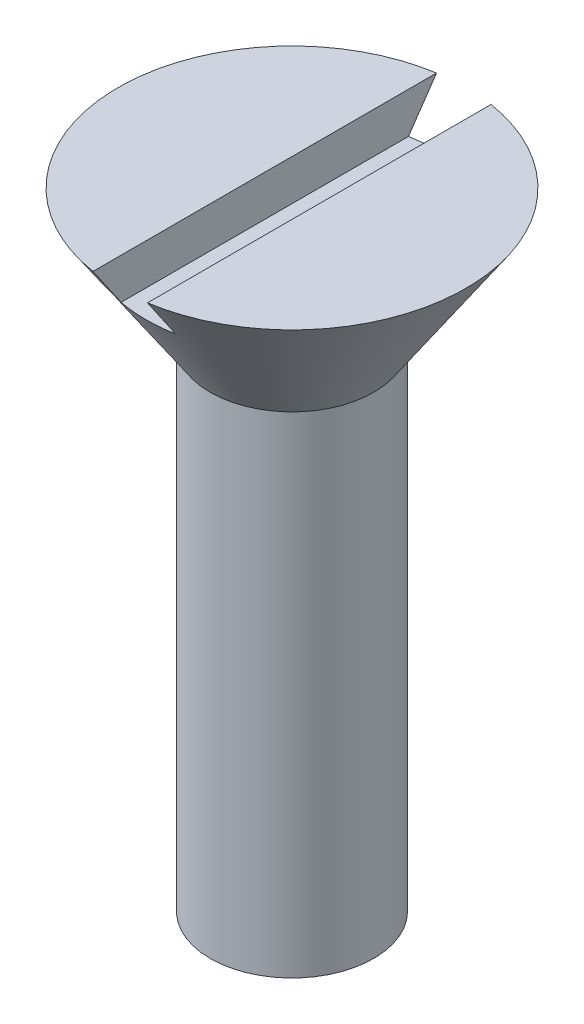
ISO-10303-21;
HEADER;
FILE_DESCRIPTION(('STEP AP214'),'2;1');
FILE_NAME('part.step','',(''),(''),'','','');
FILE_SCHEMA(('AUTOMOTIVE_DESIGN { 1 0 10303 214 1 1 1 1 }'));
ENDSEC;
DATA;
#1=APPLICATION_CONTEXT('core data for automotive mechanical design processes');
#2=APPLICATION_PROTOCOL_DEFINITION('international standard','automotive_design',2000,#1);
#3=PRODUCT_CONTEXT('',#1,'mechanical');
#4=PRODUCT('Part','Part','',(#3));
#5=PRODUCT_RELATED_PRODUCT_CATEGORY('part','',(#4));
#6=PRODUCT_DEFINITION_FORMATION('','',#4);
#7=PRODUCT_DEFINITION_CONTEXT('part definition',#1,'design');
#8=PRODUCT_DEFINITION('design','',#6,#7);
#9=PRODUCT_DEFINITION_SHAPE('','',#8);
#10=(LENGTH_UNIT() NAMED_UNIT(*) SI_UNIT(.MILLI.,.METRE.));
#11=(NAMED_UNIT(*) PLANE_ANGLE_UNIT() SI_UNIT($,.RADIAN.));
#12=(NAMED_UNIT(*) SI_UNIT($,.STERADIAN.) SOLID_ANGLE_UNIT());
#13=UNCERTAINTY_MEASURE_WITH_UNIT(LENGTH_MEASURE(1.E-05),#10,'distance_accuracy_value','');
#14=(GEOMETRIC_REPRESENTATION_CONTEXT(3) GLOBAL_UNCERTAINTY_ASSIGNED_CONTEXT((#13)) GLOBAL_UNIT_ASSIGNED_CONTEXT((#10,
#11,#12)) REPRESENTATION_CONTEXT('',''));
#15=CARTESIAN_POINT('',(0.,0.,0.));
#16=DIRECTION('',(0.,0.,1.));
#17=DIRECTION('',(1.,0.,0.));
#18=AXIS2_PLACEMENT_3D('',#15,#16,#17);
#19=CARTESIAN_POINT('',(0.,0.,0.));
#20=DIRECTION('',(0.,-1.,0.));
#21=DIRECTION('',(0.,0.,-1.));
#22=AXIS2_PLACEMENT_3D('',#19,#20,#21);
#23=PLANE('',#22);
#24=CARTESIAN_POINT('',(0.,0.,0.));
#25=DIRECTION('',(0.,1.,0.));
#26=DIRECTION('',(0.,0.,1.));
#27=AXIS2_PLACEMENT_3D('',#24,#25,#26);
#28=CIRCLE('',#27,6.385);
#29=CARTESIAN_POINT('',(-1.,0.,-6.30620527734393));
#30=VERTEX_POINT('',#29);
#31=CARTESIAN_POINT('',(-1.,0.,6.30620527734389));
#32=VERTEX_POINT('',#31);
#33=EDGE_CURVE('E120',#30,#32,#28,.T.);
#34=ORIENTED_EDGE('',*,*,#33,.T.);
#35=DIRECTION('',(0.,0.,1.));
#36=VECTOR('',#35,1.);
#37=CARTESIAN_POINT('',(-0.999999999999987,0.,-6.38500000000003));
#38=LINE('',#37,#36);
#39=EDGE_CURVE('E129',#30,#32,#38,.T.);
#40=ORIENTED_EDGE('',*,*,#39,.F.);
#41=EDGE_LOOP('',(#34,#40));
#42=FACE_BOUND('',#41,.T.);
#43=ADVANCED_FACE('F34',(#42),#23,.F.);
#44=CARTESIAN_POINT('',(0.999999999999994,0.,6.30620527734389));
#45=VERTEX_POINT('',#44);
#46=CARTESIAN_POINT('',(1.,0.,-6.30620527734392));
#47=VERTEX_POINT('',#46);
#48=EDGE_CURVE('E99',#45,#47,#28,.T.);
#49=ORIENTED_EDGE('',*,*,#48,.T.);
#50=DIRECTION('',(0.,0.,1.));
#51=VECTOR('',#50,1.);
#52=CARTESIAN_POINT('',(1.00000000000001,0.,-6.38500000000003));
#53=LINE('',#52,#51);
#54=EDGE_CURVE('E93',#47,#45,#53,.T.);
#55=ORIENTED_EDGE('',*,*,#54,.T.);
#56=EDGE_LOOP('',(#49,#55));
#57=FACE_BOUND('',#56,.T.);
#58=ADVANCED_FACE('F36',(#57),#23,.F.);
#59=CARTESIAN_POINT('',(0.,-5.,0.));
#60=DIRECTION('',(0.,1.,0.));
#61=DIRECTION('',(0.,0.,1.));
#62=AXIS2_PLACEMENT_3D('',#59,#60,#61);
#63=CONICAL_SURFACE('',#62,3.,0.595122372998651);
#64=CARTESIAN_POINT('',(0.,-1.5,0.));
#65=DIRECTION('',(0.,-1.,0.));
#66=DIRECTION('',(0.,0.,-1.));
#67=AXIS2_PLACEMENT_3D('',#64,#65,#66);
#68=CIRCLE('',#67,5.3695);
#69=CARTESIAN_POINT('',(1.00000000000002,-1.5,5.27555970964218));
#70=VERTEX_POINT('',#69);
#71=CARTESIAN_POINT('',(-0.999999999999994,-1.5,5.2755597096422));
#72=VERTEX_POINT('',#71);
#73=EDGE_CURVE('E78',#70,#72,#68,.T.);
#74=ORIENTED_EDGE('',*,*,#73,.T.);
#75=CARTESIAN_POINT('',(-1.,-6.90350895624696,1.38875171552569));
#76=CARTESIAN_POINT('',(-0.999999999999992,-6.8332015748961,1.44736594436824));
#77=CARTESIAN_POINT('',(-0.999999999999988,-6.76231638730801,1.5052762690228));
#78=CARTESIAN_POINT('',(-0.999999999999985,-6.61964733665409,1.61996716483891));
#79=CARTESIAN_POINT('',(-0.999999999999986,-6.54786355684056,1.67674783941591));
#80=CARTESIAN_POINT('',(-0.999999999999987,-6.40365845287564,1.78945470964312));
#81=CARTESIAN_POINT('',(-0.999999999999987,-6.33123728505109,1.84538110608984));
#82=CARTESIAN_POINT('',(-0.999999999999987,-6.18588439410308,1.95656982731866));
#83=CARTESIAN_POINT('',(-0.999999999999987,-6.11295265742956,2.01183213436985));
#84=CARTESIAN_POINT('',(-0.999999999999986,-5.89362110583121,2.17679172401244));
#85=CARTESIAN_POINT('',(-0.999999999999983,-5.74663095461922,2.28570350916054));
#86=CARTESIAN_POINT('',(-0.99999999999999,-5.45162144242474,2.50214259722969));
#87=CARTESIAN_POINT('',(-1.,-5.30360200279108,2.60966979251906));
#88=CARTESIAN_POINT('',(-1.,-4.9776447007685,2.84482016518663));
#89=CARTESIAN_POINT('',(-0.999999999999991,-4.79955427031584,2.97223167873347));
#90=CARTESIAN_POINT('',(-0.999999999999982,-4.44268749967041,3.22609061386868));
#91=CARTESIAN_POINT('',(-0.999999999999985,-4.26391115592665,3.35253803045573));
#92=CARTESIAN_POINT('',(-0.999999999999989,-3.72686966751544,3.73085317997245));
#93=CARTESIAN_POINT('',(-0.999999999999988,-3.36788501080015,3.98169886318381));
#94=CARTESIAN_POINT('',(-0.999999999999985,-2.64871797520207,4.4819664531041));
#95=CARTESIAN_POINT('',(-0.999999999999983,-2.28853518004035,4.73138775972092));
#96=CARTESIAN_POINT('',(-0.99999999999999,-1.56750489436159,5.22926709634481));
#97=CARTESIAN_POINT('',(-0.999999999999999,-1.20665740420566,5.47772512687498));
#98=CARTESIAN_POINT('',(-1.,-0.33382655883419,6.07757757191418));
#99=CARTESIAN_POINT('',(-0.999999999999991,0.178376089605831,6.42865269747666));
#100=CARTESIAN_POINT('',(-0.999999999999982,1.20330768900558,7.13003407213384));
#101=CARTESIAN_POINT('',(-0.999999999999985,1.7160366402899,7.4803403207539));
#102=CARTESIAN_POINT('',(-0.999999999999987,2.74148557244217,8.18020930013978));
#103=CARTESIAN_POINT('',(-0.999999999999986,3.25420531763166,8.5297723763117));
#104=CARTESIAN_POINT('',(-0.999999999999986,4.27988756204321,9.22854007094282));
#105=CARTESIAN_POINT('',(-0.999999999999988,4.7928500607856,9.57774469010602));
#106=CARTESIAN_POINT('',(-0.999999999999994,5.30588491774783,9.92684274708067));
#107=B_SPLINE_CURVE_WITH_KNOTS('',3,(#75,#76,#77,#78,#79,#80,#81,#82,#83,#84,#85,#86,#87,#88,
#89,#90,#91,#92,#93,#94,#95,#96,#97,#98,#99,#100,#101,#102,#103,#104,#105,#106),.UNSPECIFIED.,
.F.,.F.,(4,2,2,2,2,2,2,2,2,2,2,2,2,2,2,4),(0.,0.274592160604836,0.549159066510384,
0.823660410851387,1.09816906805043,1.64698149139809,2.19583632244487,2.85275512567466,
3.50967733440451,4.82349572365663,6.13783190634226,7.45216737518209,9.31507994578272,
11.1779936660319,13.0396279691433,14.9012586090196),.UNSPECIFIED.);
#108=EDGE_CURVE('E11',#72,#32,#107,.T.);
#109=ORIENTED_EDGE('',*,*,#108,.T.);
#110=ORIENTED_EDGE('',*,*,#33,.F.);
#111=CARTESIAN_POINT('',(-0.999999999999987,5.30588491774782,-9.9268427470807));
#112=CARTESIAN_POINT('',(-0.999999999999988,4.79263206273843,-9.5775961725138));
#113=CARTESIAN_POINT('',(-0.999999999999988,4.2794514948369,-9.22824311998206));
#114=CARTESIAN_POINT('',(-0.999999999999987,3.25335227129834,-8.52919107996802));
#115=CARTESIAN_POINT('',(-0.999999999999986,2.74043360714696,-8.17949210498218));
#116=CARTESIAN_POINT('',(-0.999999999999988,1.71500377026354,-7.47963461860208));
#117=CARTESIAN_POINT('',(-0.99999999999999,1.20249255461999,-7.12947617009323));
#118=CARTESIAN_POINT('',(-0.999999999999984,0.177977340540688,-6.42837990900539));
#119=CARTESIAN_POINT('',(-0.999999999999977,-0.334026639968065,-6.07744207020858));
#120=CARTESIAN_POINT('',(-0.999999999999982,-1.10143837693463,-5.55003583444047));
#121=CARTESIAN_POINT('',(-0.999999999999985,-1.35717461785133,-5.37404550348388));
#122=CARTESIAN_POINT('',(-0.999999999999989,-1.86834818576,-5.02163598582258));
#123=CARTESIAN_POINT('',(-0.999999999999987,-2.12378551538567,-4.84521680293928));
#124=CARTESIAN_POINT('',(-0.999999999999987,-2.63423012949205,-4.49180780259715));
#125=CARTESIAN_POINT('',(-0.999999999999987,-2.88923745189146,-4.3148180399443));
#126=CARTESIAN_POINT('',(-0.999999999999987,-3.39867790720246,-3.9599963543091));
#127=CARTESIAN_POINT('',(-0.999999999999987,-3.65311102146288,-3.78216440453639));
#128=CARTESIAN_POINT('',(-0.999999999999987,-4.16118973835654,-3.42520593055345));
#129=CARTESIAN_POINT('',(-0.999999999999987,-4.41483506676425,-3.2460790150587));
#130=CARTESIAN_POINT('',(-0.999999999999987,-4.79422906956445,-2.97590559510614));
#131=CARTESIAN_POINT('',(-0.999999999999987,-4.9205086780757,-2.88560500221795));
#132=CARTESIAN_POINT('',(-0.999999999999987,-5.1725998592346,-2.70434666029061));
#133=CARTESIAN_POINT('',(-0.999999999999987,-5.29841142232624,-2.61338889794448));
#134=CARTESIAN_POINT('',(-0.999999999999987,-5.54944834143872,-2.43056436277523));
#135=CARTESIAN_POINT('',(-0.999999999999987,-5.67467344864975,-2.33869724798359));
#136=CARTESIAN_POINT('',(-0.999999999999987,-5.92422920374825,-2.15376624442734));
#137=CARTESIAN_POINT('',(-0.999999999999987,-6.04855990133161,-2.06070242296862));
#138=CARTESIAN_POINT('',(-0.999999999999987,-6.2340909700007,-1.91979096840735));
#139=CARTESIAN_POINT('',(-0.999999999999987,-6.29578445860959,-1.87259288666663));
#140=CARTESIAN_POINT('',(-0.999999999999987,-6.41875769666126,-1.77766277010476));
#141=CARTESIAN_POINT('',(-0.999999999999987,-6.48003745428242,-1.72993074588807));
#142=CARTESIAN_POINT('',(-0.999999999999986,-6.6020922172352,-1.63380015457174));
#143=CARTESIAN_POINT('',(-0.999999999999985,-6.66286712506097,-1.5854014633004));
#144=CARTESIAN_POINT('',(-0.999999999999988,-6.78373900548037,-1.48775733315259));
#145=CARTESIAN_POINT('',(-0.999999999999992,-6.8438359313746,-1.4385118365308));
#146=CARTESIAN_POINT('',(-1.,-6.90350895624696,-1.38875171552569));
#147=B_SPLINE_CURVE_WITH_KNOTS('',3,(#111,#112,#113,#114,#115,#116,#117,#118,#119,#120,#121,
#122,#123,#124,#125,#126,#127,#128,#129,#130,#131,#132,#133,#134,#135,#136,#137,#138,#139,#140,
#141,#142,#143,#144,#145,#146),.UNSPECIFIED.,.F.,.F.,(4,2,2,2,2,2,2,2,2,2,2,2,2,2,2,2,2,4),(0.,
1.86242200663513,3.72477902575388,5.58690332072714,7.44909123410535,8.38041394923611,
9.31172839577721,10.2429559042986,11.1742132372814,12.105764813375,12.5714957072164,
13.037236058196,13.5031587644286,13.9690553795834,14.2020846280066,14.4351092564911,
14.6681778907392,14.9012624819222),.UNSPECIFIED.);
#148=CARTESIAN_POINT('',(-0.999999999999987,-1.5,-5.27555970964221));
#149=VERTEX_POINT('',#148);
#150=EDGE_CURVE('E84',#30,#149,#147,.T.);
#151=ORIENTED_EDGE('',*,*,#150,.T.);
#152=CARTESIAN_POINT('',(1.00000000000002,-1.5,-5.27555970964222));
#153=VERTEX_POINT('',#152);
#154=EDGE_CURVE('E86',#149,#153,#68,.T.);
#155=ORIENTED_EDGE('',*,*,#154,.T.);
#156=CARTESIAN_POINT('',(1.00000000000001,-6.90350895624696,-1.38875171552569));
#157=CARTESIAN_POINT('',(1.00000000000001,-6.83320157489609,-1.44736594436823));
#158=CARTESIAN_POINT('',(1.00000000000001,-6.762316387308,-1.50527626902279));
#159=CARTESIAN_POINT('',(1.00000000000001,-6.61964733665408,-1.6199671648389));
#160=CARTESIAN_POINT('',(1.00000000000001,-6.54786355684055,-1.6767478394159));
#161=CARTESIAN_POINT('',(1.00000000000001,-6.40365845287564,-1.78945470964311));
#162=CARTESIAN_POINT('',(1.00000000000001,-6.33123728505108,-1.84538110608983));
#163=CARTESIAN_POINT('',(1.00000000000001,-6.18588439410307,-1.95656982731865));
#164=CARTESIAN_POINT('',(1.00000000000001,-6.11295265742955,-2.01183213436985));
#165=CARTESIAN_POINT('',(1.00000000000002,-5.8936211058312,-2.17679172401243));
#166=CARTESIAN_POINT('',(1.00000000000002,-5.74663095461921,-2.28570350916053));
#167=CARTESIAN_POINT('',(1.00000000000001,-5.45162144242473,-2.50214259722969));
#168=CARTESIAN_POINT('',(1.,-5.30360200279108,-2.60966979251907));
#169=CARTESIAN_POINT('',(1.,-4.9776447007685,-2.84482016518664));
#170=CARTESIAN_POINT('',(1.00000000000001,-4.79955427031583,-2.97223167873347));
#171=CARTESIAN_POINT('',(1.00000000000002,-4.4426874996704,-3.22609061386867));
#172=CARTESIAN_POINT('',(1.00000000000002,-4.26391115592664,-3.35253803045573));
#173=CARTESIAN_POINT('',(1.00000000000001,-3.72686966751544,-3.73085317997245));
#174=CARTESIAN_POINT('',(1.00000000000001,-3.36788501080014,-3.98169886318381));
#175=CARTESIAN_POINT('',(1.00000000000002,-2.64871797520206,-4.48196645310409));
#176=CARTESIAN_POINT('',(1.00000000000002,-2.28853518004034,-4.73138775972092));
#177=CARTESIAN_POINT('',(1.00000000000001,-1.56750489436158,-5.22926709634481));
#178=CARTESIAN_POINT('',(1.00000000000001,-1.20665740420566,-5.47772512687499));
#179=CARTESIAN_POINT('',(1.00000000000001,-0.33382655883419,-6.07757757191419));
#180=CARTESIAN_POINT('',(1.00000000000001,0.178376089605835,-6.42865269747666));
#181=CARTESIAN_POINT('',(1.00000000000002,1.20330768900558,-7.13003407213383));
#182=CARTESIAN_POINT('',(1.00000000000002,1.71603664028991,-7.4803403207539));
#183=CARTESIAN_POINT('',(1.00000000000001,2.74148557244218,-8.18020930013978));
#184=CARTESIAN_POINT('',(1.00000000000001,3.25420531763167,-8.5297723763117));
#185=CARTESIAN_POINT('',(1.00000000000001,4.27988756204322,-9.22854007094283));
#186=CARTESIAN_POINT('',(1.00000000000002,4.79285006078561,-9.57774469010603));
#187=CARTESIAN_POINT('',(1.00000000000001,5.30588491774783,-9.9268427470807));
#188=B_SPLINE_CURVE_WITH_KNOTS('',3,(#156,#157,#158,#159,#160,#161,#162,#163,#164,#165,#166,
#167,#168,#169,#170,#171,#172,#173,#174,#175,#176,#177,#178,#179,#180,#181,#182,#183,#184,#185,
#186,#187),.UNSPECIFIED.,.F.,.F.,(4,2,2,2,2,2,2,2,2,2,2,2,2,2,2,4),(0.,0.274592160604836,
0.549159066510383,0.823660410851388,1.09816906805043,1.6469814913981,2.19583632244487,
2.85275512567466,3.50967733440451,4.82349572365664,6.13783190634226,7.45216737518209,
9.31507994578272,11.1779936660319,13.0396279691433,14.9012586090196),.UNSPECIFIED.);
#189=EDGE_CURVE('E91',#153,#47,#188,.T.);
#190=ORIENTED_EDGE('',*,*,#189,.T.);
#191=ORIENTED_EDGE('',*,*,#48,.F.);
#192=CARTESIAN_POINT('',(1.00000000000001,5.30588491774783,9.92684274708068));
#193=CARTESIAN_POINT('',(1.00000000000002,4.79263206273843,9.57759617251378));
#194=CARTESIAN_POINT('',(1.00000000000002,4.27945149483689,9.22824311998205));
#195=CARTESIAN_POINT('',(1.00000000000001,3.25335227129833,8.52919107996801));
#196=CARTESIAN_POINT('',(1.00000000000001,2.74043360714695,8.17949210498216));
#197=CARTESIAN_POINT('',(1.00000000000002,1.71500377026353,7.47963461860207));
#198=CARTESIAN_POINT('',(1.00000000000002,1.20249255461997,7.12947617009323));
#199=CARTESIAN_POINT('',(1.00000000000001,0.177977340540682,6.42837990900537));
#200=CARTESIAN_POINT('',(0.999999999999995,-0.334026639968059,6.07744207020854));
#201=CARTESIAN_POINT('',(1.,-1.10143837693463,5.55003583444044));
#202=CARTESIAN_POINT('',(1.00000000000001,-1.35717461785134,5.37404550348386));
#203=CARTESIAN_POINT('',(1.00000000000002,-1.86834818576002,5.02163598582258));
#204=CARTESIAN_POINT('',(1.00000000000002,-2.12378551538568,4.84521680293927));
#205=CARTESIAN_POINT('',(1.00000000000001,-2.63423012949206,4.49180780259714));
#206=CARTESIAN_POINT('',(1.00000000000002,-2.88923745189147,4.31481803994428));
#207=CARTESIAN_POINT('',(1.00000000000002,-3.39867790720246,3.95999635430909));
#208=CARTESIAN_POINT('',(1.00000000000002,-3.65311102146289,3.78216440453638));
#209=CARTESIAN_POINT('',(1.00000000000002,-4.16118973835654,3.42520593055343));
#210=CARTESIAN_POINT('',(1.00000000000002,-4.41483506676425,3.24607901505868));
#211=CARTESIAN_POINT('',(1.00000000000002,-4.79422906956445,2.97590559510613));
#212=CARTESIAN_POINT('',(1.00000000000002,-4.9205086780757,2.88560500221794));
#213=CARTESIAN_POINT('',(1.00000000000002,-5.1725998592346,2.7043466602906));
#214=CARTESIAN_POINT('',(1.00000000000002,-5.29841142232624,2.61338889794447));
#215=CARTESIAN_POINT('',(1.00000000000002,-5.54944834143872,2.43056436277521));
#216=CARTESIAN_POINT('',(1.00000000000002,-5.67467344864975,2.33869724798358));
#217=CARTESIAN_POINT('',(1.00000000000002,-5.92422920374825,2.15376624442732));
#218=CARTESIAN_POINT('',(1.00000000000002,-6.04855990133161,2.0607024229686));
#219=CARTESIAN_POINT('',(1.00000000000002,-6.2340909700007,1.91979096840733));
#220=CARTESIAN_POINT('',(1.00000000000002,-6.29578445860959,1.87259288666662));
#221=CARTESIAN_POINT('',(1.00000000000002,-6.41875769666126,1.77766277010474));
#222=CARTESIAN_POINT('',(1.00000000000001,-6.48003745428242,1.72993074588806));
#223=CARTESIAN_POINT('',(1.00000000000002,-6.6020922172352,1.63380015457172));
#224=CARTESIAN_POINT('',(1.00000000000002,-6.66286712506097,1.58540146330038));
#225=CARTESIAN_POINT('',(1.00000000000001,-6.78373900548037,1.48775733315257));
#226=CARTESIAN_POINT('',(1.00000000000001,-6.8438359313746,1.43851183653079));
#227=CARTESIAN_POINT('',(1.,-6.90350895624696,1.38875171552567));
#228=B_SPLINE_CURVE_WITH_KNOTS('',3,(#192,#193,#194,#195,#196,#197,#198,#199,#200,#201,#202,
#203,#204,#205,#206,#207,#208,#209,#210,#211,#212,#213,#214,#215,#216,#217,#218,#219,#220,#221,
#222,#223,#224,#225,#226,#227),.UNSPECIFIED.,.F.,.F.,(4,2,2,2,2,2,2,2,2,2,2,2,2,2,2,2,2,4),(0.,
1.86242200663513,3.72477902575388,5.58690332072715,7.44909123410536,8.38041394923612,
9.31172839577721,10.2429559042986,11.1742132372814,12.105764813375,12.5714957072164,
13.037236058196,13.5031587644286,13.9690553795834,14.2020846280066,14.4351092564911,
14.6681778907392,14.9012624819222),.UNSPECIFIED.);
#229=EDGE_CURVE('E46',#45,#70,#228,.T.);
#230=ORIENTED_EDGE('',*,*,#229,.T.);
#231=EDGE_LOOP('',(#74,#109,#110,#151,#155,#190,#191,#230));
#232=FACE_BOUND('',#231,.T.);
#233=CARTESIAN_POINT('',(0.,-5.,0.));
#234=DIRECTION('',(0.,1.,0.));
#235=DIRECTION('',(0.,0.,1.));
#236=AXIS2_PLACEMENT_3D('',#233,#234,#235);
#237=CIRCLE('',#236,3.);
#238=CARTESIAN_POINT('',(0.,-5.,3.00000000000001));
#239=VERTEX_POINT('',#238);
#240=EDGE_CURVE('E123',#239,#239,#237,.T.);
#241=ORIENTED_EDGE('',*,*,#240,.T.);
#242=EDGE_LOOP('',(#241));
#243=FACE_BOUND('',#242,.T.);
#244=ADVANCED_FACE('F96',(#232,#243),#63,.T.);
#245=CARTESIAN_POINT('',(0.,0.,0.));
#246=DIRECTION('',(0.,1.,0.));
#247=DIRECTION('',(0.,0.,1.));
#248=AXIS2_PLACEMENT_3D('',#245,#246,#247);
#249=CYLINDRICAL_SURFACE('',#248,3.);
#250=ORIENTED_EDGE('',*,*,#240,.F.);
#251=EDGE_LOOP('',(#250));
#252=FACE_BOUND('',#251,.T.);
#253=CARTESIAN_POINT('',(0.,-23.,0.));
#254=DIRECTION('',(0.,1.,0.));
#255=DIRECTION('',(0.,0.,1.));
#256=AXIS2_PLACEMENT_3D('',#253,#254,#255);
#257=CIRCLE('',#256,3.);
#258=CARTESIAN_POINT('',(0.,-23.,3.00000000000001));
#259=VERTEX_POINT('',#258);
#260=EDGE_CURVE('E126',#259,#259,#257,.T.);
#261=ORIENTED_EDGE('',*,*,#260,.T.);
#262=EDGE_LOOP('',(#261));
#263=FACE_BOUND('',#262,.T.);
#264=ADVANCED_FACE('F145',(#252,#263),#249,.T.);
#265=CARTESIAN_POINT('',(0.,-24.7320508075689,0.));
#266=DIRECTION('',(0.,1.,0.));
#267=DIRECTION('',(0.,0.,1.));
#268=AXIS2_PLACEMENT_3D('',#265,#266,#267);
#269=CONICAL_SURFACE('',#268,0.,1.04719755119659);
#270=ORIENTED_EDGE('',*,*,#260,.F.);
#271=EDGE_LOOP('',(#270));
#272=FACE_BOUND('',#271,.T.);
#273=CARTESIAN_POINT('',(0.,-24.7320508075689,0.));
#274=VERTEX_POINT('',#273);
#275=VERTEX_LOOP('',#274);
#276=FACE_BOUND('',#275,.T.);
#277=ADVANCED_FACE('F149',(#272,#276),#269,.T.);
#278=CARTESIAN_POINT('',(-0.999999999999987,0.,-6.38500000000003));
#279=DIRECTION('',(-1.,0.,0.));
#280=DIRECTION('',(0.,0.,1.));
#281=AXIS2_PLACEMENT_3D('',#278,#279,#280);
#282=PLANE('',#281);
#283=ORIENTED_EDGE('',*,*,#39,.T.);
#284=ORIENTED_EDGE('',*,*,#108,.F.);
#285=DIRECTION('',(0.,0.,1.));
#286=VECTOR('',#285,1.);
#287=CARTESIAN_POINT('',(-0.999999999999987,-1.5,-6.38500000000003));
#288=LINE('',#287,#286);
#289=EDGE_CURVE('E81',#149,#72,#288,.T.);
#290=ORIENTED_EDGE('',*,*,#289,.F.);
#291=ORIENTED_EDGE('',*,*,#150,.F.);
#292=EDGE_LOOP('',(#283,#284,#290,#291));
#293=FACE_BOUND('',#292,.T.);
#294=ADVANCED_FACE('F114',(#293),#282,.F.);
#295=CARTESIAN_POINT('',(1.00000000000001,0.,-6.38500000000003));
#296=DIRECTION('',(1.,0.,0.));
#297=DIRECTION('',(0.,0.,-1.));
#298=AXIS2_PLACEMENT_3D('',#295,#296,#297);
#299=PLANE('',#298);
#300=DIRECTION('',(0.,0.,1.));
#301=VECTOR('',#300,1.);
#302=CARTESIAN_POINT('',(1.00000000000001,-1.5,-6.38500000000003));
#303=LINE('',#302,#301);
#304=EDGE_CURVE('E53',#153,#70,#303,.T.);
#305=ORIENTED_EDGE('',*,*,#304,.T.);
#306=ORIENTED_EDGE('',*,*,#229,.F.);
#307=ORIENTED_EDGE('',*,*,#54,.F.);
#308=ORIENTED_EDGE('',*,*,#189,.F.);
#309=EDGE_LOOP('',(#305,#306,#307,#308));
#310=FACE_BOUND('',#309,.T.);
#311=ADVANCED_FACE('F88',(#310),#299,.F.);
#312=CARTESIAN_POINT('',(-0.999999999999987,-1.5,-6.38500000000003));
#313=DIRECTION('',(0.,-1.,0.));
#314=DIRECTION('',(0.,0.,-1.));
#315=AXIS2_PLACEMENT_3D('',#312,#313,#314);
#316=PLANE('',#315);
#317=ORIENTED_EDGE('',*,*,#304,.F.);
#318=ORIENTED_EDGE('',*,*,#154,.F.);
#319=ORIENTED_EDGE('',*,*,#289,.T.);
#320=ORIENTED_EDGE('',*,*,#73,.F.);
#321=EDGE_LOOP('',(#317,#318,#319,#320));
#322=FACE_BOUND('',#321,.T.);
#323=ADVANCED_FACE('F79',(#322),#316,.F.);
#324=CLOSED_SHELL('',(#43,#58,#244,#264,#277,#294,#311,#323));
#325=MANIFOLD_SOLID_BREP('B2',#324);
#326=ADVANCED_BREP_SHAPE_REPRESENTATION('',(#18,#325),#14);
#327=SHAPE_DEFINITION_REPRESENTATION(#9,#326);
ENDSEC;
END-ISO-10303-21;
